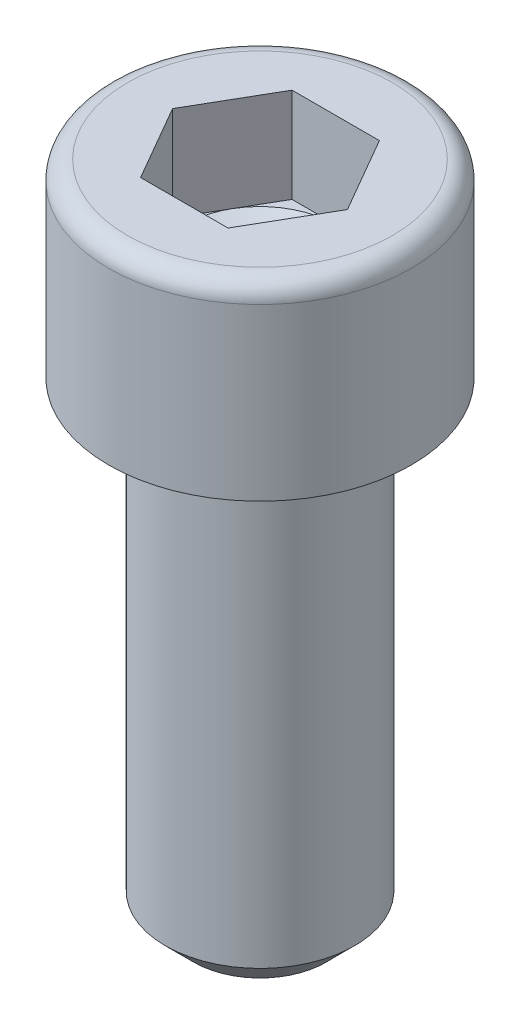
ISO-10303-21;
HEADER;
FILE_DESCRIPTION(('STEP AP214'),'2;1');
FILE_NAME('part.step','',(''),(''),'','','');
FILE_SCHEMA(('AUTOMOTIVE_DESIGN { 1 0 10303 214 1 1 1 1 }'));
ENDSEC;
DATA;
#1=APPLICATION_CONTEXT('core data for automotive mechanical design processes');
#2=APPLICATION_PROTOCOL_DEFINITION('international standard','automotive_design',2000,#1);
#3=PRODUCT_CONTEXT('',#1,'mechanical');
#4=PRODUCT('Part','Part','',(#3));
#5=PRODUCT_RELATED_PRODUCT_CATEGORY('part','',(#4));
#6=PRODUCT_DEFINITION_FORMATION('','',#4);
#7=PRODUCT_DEFINITION_CONTEXT('part definition',#1,'design');
#8=PRODUCT_DEFINITION('design','',#6,#7);
#9=PRODUCT_DEFINITION_SHAPE('','',#8);
#10=(LENGTH_UNIT() NAMED_UNIT(*) SI_UNIT(.MILLI.,.METRE.));
#11=(NAMED_UNIT(*) PLANE_ANGLE_UNIT() SI_UNIT($,.RADIAN.));
#12=(NAMED_UNIT(*) SI_UNIT($,.STERADIAN.) SOLID_ANGLE_UNIT());
#13=UNCERTAINTY_MEASURE_WITH_UNIT(LENGTH_MEASURE(1.E-05),#10,'distance_accuracy_value','');
#14=(GEOMETRIC_REPRESENTATION_CONTEXT(3) GLOBAL_UNCERTAINTY_ASSIGNED_CONTEXT((#13)) GLOBAL_UNIT_ASSIGNED_CONTEXT((#10,
#11,#12)) REPRESENTATION_CONTEXT('',''));
#15=CARTESIAN_POINT('',(0.,0.,0.));
#16=DIRECTION('',(0.,0.,1.));
#17=DIRECTION('',(1.,0.,0.));
#18=AXIS2_PLACEMENT_3D('',#15,#16,#17);
#19=CARTESIAN_POINT('',(4.,10.,0.));
#20=DIRECTION('',(0.,-1.,0.));
#21=DIRECTION('',(1.,0.,0.));
#22=AXIS2_PLACEMENT_3D('',#19,#20,#21);
#23=PLANE('',#22);
#24=CARTESIAN_POINT('',(0.,10.,0.));
#25=DIRECTION('',(0.,1.,0.));
#26=DIRECTION('',(-1.,0.,0.));
#27=AXIS2_PLACEMENT_3D('',#24,#25,#26);
#28=CIRCLE('',#27,7.);
#29=CARTESIAN_POINT('',(-7.,10.,0.));
#30=VERTEX_POINT('',#29);
#31=EDGE_CURVE('E138',#30,#30,#28,.T.);
#32=ORIENTED_EDGE('',*,*,#31,.T.);
#33=EDGE_LOOP('',(#32));
#34=FACE_BOUND('',#33,.T.);
#35=DIRECTION('',(0.499999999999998,0.,0.86602540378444));
#36=VECTOR('',#35,1.);
#37=CARTESIAN_POINT('',(2.30940107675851,10.,-4.));
#38=LINE('',#37,#36);
#39=CARTESIAN_POINT('',(2.30940107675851,10.,-4.));
#40=VERTEX_POINT('',#39);
#41=CARTESIAN_POINT('',(4.618802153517,10.,0.));
#42=VERTEX_POINT('',#41);
#43=EDGE_CURVE('E370',#40,#42,#38,.T.);
#44=ORIENTED_EDGE('',*,*,#43,.T.);
#45=DIRECTION('',(-0.499999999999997,0.,0.86602540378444));
#46=VECTOR('',#45,1.);
#47=CARTESIAN_POINT('',(2.30940107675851,10.,4.));
#48=LINE('',#47,#46);
#49=CARTESIAN_POINT('',(2.30940107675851,10.,4.));
#50=VERTEX_POINT('',#49);
#51=EDGE_CURVE('E373',#42,#50,#48,.T.);
#52=ORIENTED_EDGE('',*,*,#51,.T.);
#53=DIRECTION('',(-1.,0.,0.));
#54=VECTOR('',#53,1.);
#55=CARTESIAN_POINT('',(2.30940107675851,10.,4.));
#56=LINE('',#55,#54);
#57=CARTESIAN_POINT('',(-2.30940107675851,10.,4.));
#58=VERTEX_POINT('',#57);
#59=EDGE_CURVE('E376',#50,#58,#56,.T.);
#60=ORIENTED_EDGE('',*,*,#59,.T.);
#61=DIRECTION('',(-0.499999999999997,0.,-0.86602540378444));
#62=VECTOR('',#61,1.);
#63=CARTESIAN_POINT('',(-2.30940107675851,10.,4.));
#64=LINE('',#63,#62);
#65=CARTESIAN_POINT('',(-4.618802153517,10.,0.));
#66=VERTEX_POINT('',#65);
#67=EDGE_CURVE('E115',#58,#66,#64,.T.);
#68=ORIENTED_EDGE('',*,*,#67,.T.);
#69=DIRECTION('',(0.499999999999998,0.,-0.86602540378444));
#70=VECTOR('',#69,1.);
#71=CARTESIAN_POINT('',(-2.30940107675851,10.,-4.));
#72=LINE('',#71,#70);
#73=CARTESIAN_POINT('',(-2.30940107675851,10.,-4.));
#74=VERTEX_POINT('',#73);
#75=EDGE_CURVE('E367',#66,#74,#72,.T.);
#76=ORIENTED_EDGE('',*,*,#75,.T.);
#77=DIRECTION('',(1.,0.,0.));
#78=VECTOR('',#77,1.);
#79=CARTESIAN_POINT('',(2.30940107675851,10.,-4.));
#80=LINE('',#79,#78);
#81=EDGE_CURVE('E126',#74,#40,#80,.T.);
#82=ORIENTED_EDGE('',*,*,#81,.T.);
#83=EDGE_LOOP('',(#44,#52,#60,#68,#76,#82));
#84=FACE_BOUND('',#83,.T.);
#85=ADVANCED_FACE('F32',(#34,#84),#23,.F.);
#86=CARTESIAN_POINT('',(0.,-25.,0.));
#87=DIRECTION('',(0.,1.,0.));
#88=DIRECTION('',(0.,0.,1.));
#89=AXIS2_PLACEMENT_3D('',#86,#87,#88);
#90=CYLINDRICAL_SURFACE('',#89,5.);
#91=CARTESIAN_POINT('',(0.,-23.5,0.));
#92=DIRECTION('',(0.,1.,0.));
#93=DIRECTION('',(0.,0.,1.));
#94=AXIS2_PLACEMENT_3D('',#91,#92,#93);
#95=CIRCLE('',#94,5.);
#96=CARTESIAN_POINT('',(0.,-23.5,5.));
#97=VERTEX_POINT('',#96);
#98=EDGE_CURVE('E40',#97,#97,#95,.T.);
#99=ORIENTED_EDGE('',*,*,#98,.T.);
#100=EDGE_LOOP('',(#99));
#101=FACE_BOUND('',#100,.T.);
#102=CARTESIAN_POINT('',(0.,0.,0.));
#103=DIRECTION('',(0.,1.,0.));
#104=DIRECTION('',(0.,0.,1.));
#105=AXIS2_PLACEMENT_3D('',#102,#103,#104);
#106=CIRCLE('',#105,5.);
#107=CARTESIAN_POINT('',(0.,0.,5.));
#108=VERTEX_POINT('',#107);
#109=EDGE_CURVE('E148',#108,#108,#106,.T.);
#110=ORIENTED_EDGE('',*,*,#109,.F.);
#111=EDGE_LOOP('',(#110));
#112=FACE_BOUND('',#111,.T.);
#113=ADVANCED_FACE('F153',(#101,#112),#90,.T.);
#114=CARTESIAN_POINT('',(0.,-25.,0.));
#115=DIRECTION('',(0.,1.,0.));
#116=DIRECTION('',(0.,0.,1.));
#117=AXIS2_PLACEMENT_3D('',#114,#115,#116);
#118=PLANE('',#117);
#119=CARTESIAN_POINT('',(0.,-25.,0.));
#120=DIRECTION('',(0.,1.,0.));
#121=DIRECTION('',(0.,0.,1.));
#122=AXIS2_PLACEMENT_3D('',#119,#120,#121);
#123=CIRCLE('',#122,3.49999999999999);
#124=CARTESIAN_POINT('',(0.,-25.,3.49999999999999));
#125=VERTEX_POINT('',#124);
#126=EDGE_CURVE('E11',#125,#125,#123,.F.);
#127=ORIENTED_EDGE('',*,*,#126,.T.);
#128=EDGE_LOOP('',(#127));
#129=FACE_BOUND('',#128,.T.);
#130=ADVANCED_FACE('F158',(#129),#118,.F.);
#131=CARTESIAN_POINT('',(0.,-23.5,0.));
#132=DIRECTION('',(0.,1.,0.));
#133=DIRECTION('',(0.,0.,1.));
#134=AXIS2_PLACEMENT_3D('',#131,#132,#133);
#135=CONICAL_SURFACE('',#134,5.,0.785398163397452);
#136=ORIENTED_EDGE('',*,*,#126,.F.);
#137=EDGE_LOOP('',(#136));
#138=FACE_BOUND('',#137,.T.);
#139=ORIENTED_EDGE('',*,*,#98,.F.);
#140=EDGE_LOOP('',(#139));
#141=FACE_BOUND('',#140,.T.);
#142=ADVANCED_FACE('F34',(#138,#141),#135,.T.);
#143=CARTESIAN_POINT('',(0.,0.,0.));
#144=DIRECTION('',(0.,1.,0.));
#145=DIRECTION('',(-1.,0.,0.));
#146=AXIS2_PLACEMENT_3D('',#143,#144,#145);
#147=PLANE('',#146);
#148=ORIENTED_EDGE('',*,*,#109,.T.);
#149=EDGE_LOOP('',(#148));
#150=FACE_BOUND('',#149,.T.);
#151=CARTESIAN_POINT('',(0.,0.,0.));
#152=DIRECTION('',(0.,1.,0.));
#153=DIRECTION('',(-1.,0.,0.));
#154=AXIS2_PLACEMENT_3D('',#151,#152,#153);
#155=CIRCLE('',#154,8.);
#156=CARTESIAN_POINT('',(-8.,0.,0.));
#157=VERTEX_POINT('',#156);
#158=EDGE_CURVE('E145',#157,#157,#155,.T.);
#159=ORIENTED_EDGE('',*,*,#158,.F.);
#160=EDGE_LOOP('',(#159));
#161=FACE_BOUND('',#160,.T.);
#162=ADVANCED_FACE('F157',(#150,#161),#147,.F.);
#163=CARTESIAN_POINT('',(0.,10.,0.));
#164=DIRECTION('',(0.,1.,0.));
#165=DIRECTION('',(-1.,0.,0.));
#166=AXIS2_PLACEMENT_3D('',#163,#164,#165);
#167=CYLINDRICAL_SURFACE('',#166,8.);
#168=CARTESIAN_POINT('',(0.,9.,0.));
#169=DIRECTION('',(0.,1.,0.));
#170=DIRECTION('',(-1.,0.,0.));
#171=AXIS2_PLACEMENT_3D('',#168,#169,#170);
#172=CIRCLE('',#171,8.);
#173=CARTESIAN_POINT('',(-8.,9.,0.));
#174=VERTEX_POINT('',#173);
#175=EDGE_CURVE('E142',#174,#174,#172,.T.);
#176=ORIENTED_EDGE('',*,*,#175,.F.);
#177=EDGE_LOOP('',(#176));
#178=FACE_BOUND('',#177,.T.);
#179=ORIENTED_EDGE('',*,*,#158,.T.);
#180=EDGE_LOOP('',(#179));
#181=FACE_BOUND('',#180,.T.);
#182=ADVANCED_FACE('F164',(#178,#181),#167,.T.);
#183=CARTESIAN_POINT('',(0.,9.,0.));
#184=DIRECTION('',(0.,1.,0.));
#185=DIRECTION('',(-1.,0.,0.));
#186=AXIS2_PLACEMENT_3D('',#183,#184,#185);
#187=TOROIDAL_SURFACE('',#186,7.,0.999999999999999);
#188=ORIENTED_EDGE('',*,*,#31,.F.);
#189=EDGE_LOOP('',(#188));
#190=FACE_BOUND('',#189,.T.);
#191=ORIENTED_EDGE('',*,*,#175,.T.);
#192=EDGE_LOOP('',(#191));
#193=FACE_BOUND('',#192,.T.);
#194=ADVANCED_FACE('F181',(#190,#193),#187,.T.);
#195=CARTESIAN_POINT('',(-2.30940107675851,5.,-4.));
#196=DIRECTION('',(0.86602540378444,0.,0.499999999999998));
#197=DIRECTION('',(0.499999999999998,0.,-0.86602540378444));
#198=AXIS2_PLACEMENT_3D('',#195,#196,#197);
#199=PLANE('',#198);
#200=ORIENTED_EDGE('',*,*,#75,.F.);
#201=DIRECTION('',(0.,1.,0.));
#202=VECTOR('',#201,1.);
#203=CARTESIAN_POINT('',(-4.618802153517,5.,0.));
#204=LINE('',#203,#202);
#205=CARTESIAN_POINT('',(-4.618802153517,5.,0.));
#206=VERTEX_POINT('',#205);
#207=EDGE_CURVE('E362',#206,#66,#204,.T.);
#208=ORIENTED_EDGE('',*,*,#207,.F.);
#209=DIRECTION('',(0.499999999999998,0.,-0.86602540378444));
#210=VECTOR('',#209,1.);
#211=CARTESIAN_POINT('',(-2.30940107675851,5.,-4.));
#212=LINE('',#211,#210);
#213=CARTESIAN_POINT('',(-3.46410161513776,5.,-1.99999999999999));
#214=VERTEX_POINT('',#213);
#215=EDGE_CURVE('E111',#206,#214,#212,.T.);
#216=ORIENTED_EDGE('',*,*,#215,.T.);
#217=CARTESIAN_POINT('',(-2.30940107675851,5.,-4.));
#218=VERTEX_POINT('',#217);
#219=EDGE_CURVE('E105',#214,#218,#212,.T.);
#220=ORIENTED_EDGE('',*,*,#219,.T.);
#221=DIRECTION('',(0.,1.,0.));
#222=VECTOR('',#221,1.);
#223=CARTESIAN_POINT('',(-2.30940107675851,5.,-4.));
#224=LINE('',#223,#222);
#225=EDGE_CURVE('E107',#218,#74,#224,.T.);
#226=ORIENTED_EDGE('',*,*,#225,.T.);
#227=EDGE_LOOP('',(#200,#208,#216,#220,#226));
#228=FACE_BOUND('',#227,.T.);
#229=ADVANCED_FACE('F106',(#228),#199,.T.);
#230=CARTESIAN_POINT('',(2.30940107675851,5.,-4.));
#231=DIRECTION('',(0.,0.,1.));
#232=DIRECTION('',(1.,0.,0.));
#233=AXIS2_PLACEMENT_3D('',#230,#231,#232);
#234=PLANE('',#233);
#235=ORIENTED_EDGE('',*,*,#81,.F.);
#236=ORIENTED_EDGE('',*,*,#225,.F.);
#237=DIRECTION('',(1.,0.,0.));
#238=VECTOR('',#237,1.);
#239=CARTESIAN_POINT('',(2.30940107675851,5.,-4.));
#240=LINE('',#239,#238);
#241=CARTESIAN_POINT('',(0.,5.,-4.));
#242=VERTEX_POINT('',#241);
#243=EDGE_CURVE('E47',#218,#242,#240,.T.);
#244=ORIENTED_EDGE('',*,*,#243,.T.);
#245=CARTESIAN_POINT('',(2.30940107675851,5.,-4.));
#246=VERTEX_POINT('',#245);
#247=EDGE_CURVE('E121',#242,#246,#240,.T.);
#248=ORIENTED_EDGE('',*,*,#247,.T.);
#249=DIRECTION('',(0.,1.,0.));
#250=VECTOR('',#249,1.);
#251=CARTESIAN_POINT('',(2.30940107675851,5.,-4.));
#252=LINE('',#251,#250);
#253=EDGE_CURVE('E128',#246,#40,#252,.T.);
#254=ORIENTED_EDGE('',*,*,#253,.T.);
#255=EDGE_LOOP('',(#235,#236,#244,#248,#254));
#256=FACE_BOUND('',#255,.T.);
#257=ADVANCED_FACE('F123',(#256),#234,.T.);
#258=CARTESIAN_POINT('',(2.30940107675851,5.,-4.));
#259=DIRECTION('',(-0.86602540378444,0.,0.499999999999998));
#260=DIRECTION('',(0.499999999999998,0.,0.86602540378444));
#261=AXIS2_PLACEMENT_3D('',#258,#259,#260);
#262=PLANE('',#261);
#263=ORIENTED_EDGE('',*,*,#43,.F.);
#264=ORIENTED_EDGE('',*,*,#253,.F.);
#265=DIRECTION('',(0.499999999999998,0.,0.86602540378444));
#266=VECTOR('',#265,1.);
#267=CARTESIAN_POINT('',(2.30940107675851,5.,-4.));
#268=LINE('',#267,#266);
#269=CARTESIAN_POINT('',(3.46410161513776,5.,-1.99999999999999));
#270=VERTEX_POINT('',#269);
#271=EDGE_CURVE('E395',#246,#270,#268,.T.);
#272=ORIENTED_EDGE('',*,*,#271,.T.);
#273=CARTESIAN_POINT('',(4.618802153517,5.,0.));
#274=VERTEX_POINT('',#273);
#275=EDGE_CURVE('E120',#270,#274,#268,.T.);
#276=ORIENTED_EDGE('',*,*,#275,.T.);
#277=DIRECTION('',(0.,1.,0.));
#278=VECTOR('',#277,1.);
#279=CARTESIAN_POINT('',(4.618802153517,5.,0.));
#280=LINE('',#279,#278);
#281=EDGE_CURVE('E133',#274,#42,#280,.T.);
#282=ORIENTED_EDGE('',*,*,#281,.T.);
#283=EDGE_LOOP('',(#263,#264,#272,#276,#282));
#284=FACE_BOUND('',#283,.T.);
#285=ADVANCED_FACE('F211',(#284),#262,.T.);
#286=CARTESIAN_POINT('',(2.30940107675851,5.,4.));
#287=DIRECTION('',(-0.86602540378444,0.,-0.499999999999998));
#288=DIRECTION('',(-0.499999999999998,0.,0.86602540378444));
#289=AXIS2_PLACEMENT_3D('',#286,#287,#288);
#290=PLANE('',#289);
#291=ORIENTED_EDGE('',*,*,#51,.F.);
#292=ORIENTED_EDGE('',*,*,#281,.F.);
#293=DIRECTION('',(-0.499999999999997,0.,0.86602540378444));
#294=VECTOR('',#293,1.);
#295=CARTESIAN_POINT('',(2.30940107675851,5.,4.));
#296=LINE('',#295,#294);
#297=CARTESIAN_POINT('',(3.46410161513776,5.,1.99999999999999));
#298=VERTEX_POINT('',#297);
#299=EDGE_CURVE('E393',#274,#298,#296,.T.);
#300=ORIENTED_EDGE('',*,*,#299,.T.);
#301=CARTESIAN_POINT('',(2.30940107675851,5.,4.));
#302=VERTEX_POINT('',#301);
#303=EDGE_CURVE('E394',#298,#302,#296,.T.);
#304=ORIENTED_EDGE('',*,*,#303,.T.);
#305=DIRECTION('',(0.,1.,0.));
#306=VECTOR('',#305,1.);
#307=CARTESIAN_POINT('',(2.30940107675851,5.,4.));
#308=LINE('',#307,#306);
#309=EDGE_CURVE('E382',#302,#50,#308,.T.);
#310=ORIENTED_EDGE('',*,*,#309,.T.);
#311=EDGE_LOOP('',(#291,#292,#300,#304,#310));
#312=FACE_BOUND('',#311,.T.);
#313=ADVANCED_FACE('F218',(#312),#290,.T.);
#314=CARTESIAN_POINT('',(2.30940107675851,5.,4.));
#315=DIRECTION('',(0.,0.,-1.));
#316=DIRECTION('',(-1.,0.,0.));
#317=AXIS2_PLACEMENT_3D('',#314,#315,#316);
#318=PLANE('',#317);
#319=ORIENTED_EDGE('',*,*,#59,.F.);
#320=ORIENTED_EDGE('',*,*,#309,.F.);
#321=DIRECTION('',(-1.,0.,0.));
#322=VECTOR('',#321,1.);
#323=CARTESIAN_POINT('',(2.30940107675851,5.,4.));
#324=LINE('',#323,#322);
#325=CARTESIAN_POINT('',(0.,5.,4.));
#326=VERTEX_POINT('',#325);
#327=EDGE_CURVE('E357',#302,#326,#324,.T.);
#328=ORIENTED_EDGE('',*,*,#327,.T.);
#329=CARTESIAN_POINT('',(-2.30940107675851,5.,4.));
#330=VERTEX_POINT('',#329);
#331=EDGE_CURVE('E353',#326,#330,#324,.T.);
#332=ORIENTED_EDGE('',*,*,#331,.T.);
#333=DIRECTION('',(0.,1.,0.));
#334=VECTOR('',#333,1.);
#335=CARTESIAN_POINT('',(-2.30940107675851,5.,4.));
#336=LINE('',#335,#334);
#337=EDGE_CURVE('E361',#330,#58,#336,.T.);
#338=ORIENTED_EDGE('',*,*,#337,.T.);
#339=EDGE_LOOP('',(#319,#320,#328,#332,#338));
#340=FACE_BOUND('',#339,.T.);
#341=ADVANCED_FACE('F226',(#340),#318,.T.);
#342=CARTESIAN_POINT('',(-2.30940107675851,5.,4.));
#343=DIRECTION('',(0.86602540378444,0.,-0.499999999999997));
#344=DIRECTION('',(-0.499999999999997,0.,-0.86602540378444));
#345=AXIS2_PLACEMENT_3D('',#342,#343,#344);
#346=PLANE('',#345);
#347=ORIENTED_EDGE('',*,*,#67,.F.);
#348=ORIENTED_EDGE('',*,*,#337,.F.);
#349=DIRECTION('',(-0.499999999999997,0.,-0.86602540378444));
#350=VECTOR('',#349,1.);
#351=CARTESIAN_POINT('',(-2.30940107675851,5.,4.));
#352=LINE('',#351,#350);
#353=CARTESIAN_POINT('',(-3.46410161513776,5.,1.99999999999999));
#354=VERTEX_POINT('',#353);
#355=EDGE_CURVE('E352',#330,#354,#352,.T.);
#356=ORIENTED_EDGE('',*,*,#355,.T.);
#357=EDGE_CURVE('E355',#354,#206,#352,.T.);
#358=ORIENTED_EDGE('',*,*,#357,.T.);
#359=ORIENTED_EDGE('',*,*,#207,.T.);
#360=EDGE_LOOP('',(#347,#348,#356,#358,#359));
#361=FACE_BOUND('',#360,.T.);
#362=ADVANCED_FACE('F234',(#361),#346,.T.);
#363=CARTESIAN_POINT('',(-6.92820323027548,5.,4.));
#364=DIRECTION('',(0.,-1.,0.));
#365=DIRECTION('',(0.,0.,-1.));
#366=AXIS2_PLACEMENT_3D('',#363,#364,#365);
#367=PLANE('',#366);
#368=ORIENTED_EDGE('',*,*,#243,.F.);
#369=ORIENTED_EDGE('',*,*,#219,.F.);
#370=CARTESIAN_POINT('',(0.,5.,0.));
#371=DIRECTION('',(0.,1.,0.));
#372=DIRECTION('',(-1.,0.,0.));
#373=AXIS2_PLACEMENT_3D('',#370,#371,#372);
#374=CIRCLE('',#373,4.);
#375=EDGE_CURVE('E118',#242,#214,#374,.T.);
#376=ORIENTED_EDGE('',*,*,#375,.F.);
#377=EDGE_LOOP('',(#368,#369,#376));
#378=FACE_BOUND('',#377,.T.);
#379=ADVANCED_FACE('F117',(#378),#367,.F.);
#380=ORIENTED_EDGE('',*,*,#215,.F.);
#381=ORIENTED_EDGE('',*,*,#357,.F.);
#382=EDGE_CURVE('E127',#214,#354,#374,.T.);
#383=ORIENTED_EDGE('',*,*,#382,.F.);
#384=EDGE_LOOP('',(#380,#381,#383));
#385=FACE_BOUND('',#384,.T.);
#386=ADVANCED_FACE('F249',(#385),#367,.F.);
#387=ORIENTED_EDGE('',*,*,#355,.F.);
#388=ORIENTED_EDGE('',*,*,#331,.F.);
#389=EDGE_CURVE('E132',#354,#326,#374,.T.);
#390=ORIENTED_EDGE('',*,*,#389,.F.);
#391=EDGE_LOOP('',(#387,#388,#390));
#392=FACE_BOUND('',#391,.T.);
#393=ADVANCED_FACE('F257',(#392),#367,.F.);
#394=ORIENTED_EDGE('',*,*,#327,.F.);
#395=ORIENTED_EDGE('',*,*,#303,.F.);
#396=EDGE_CURVE('E139',#326,#298,#374,.T.);
#397=ORIENTED_EDGE('',*,*,#396,.F.);
#398=EDGE_LOOP('',(#394,#395,#397));
#399=FACE_BOUND('',#398,.T.);
#400=ADVANCED_FACE('F264',(#399),#367,.F.);
#401=ORIENTED_EDGE('',*,*,#299,.F.);
#402=ORIENTED_EDGE('',*,*,#275,.F.);
#403=EDGE_CURVE('E399',#298,#270,#374,.T.);
#404=ORIENTED_EDGE('',*,*,#403,.F.);
#405=EDGE_LOOP('',(#401,#402,#404));
#406=FACE_BOUND('',#405,.T.);
#407=ADVANCED_FACE('F271',(#406),#367,.F.);
#408=ORIENTED_EDGE('',*,*,#271,.F.);
#409=ORIENTED_EDGE('',*,*,#247,.F.);
#410=EDGE_CURVE('E398',#270,#242,#374,.T.);
#411=ORIENTED_EDGE('',*,*,#410,.F.);
#412=EDGE_LOOP('',(#408,#409,#411));
#413=FACE_BOUND('',#412,.T.);
#414=ADVANCED_FACE('F251',(#413),#367,.F.);
#415=CARTESIAN_POINT('',(0.,5.,0.));
#416=DIRECTION('',(0.,1.,0.));
#417=DIRECTION('',(-1.,0.,0.));
#418=AXIS2_PLACEMENT_3D('',#415,#416,#417);
#419=CONICAL_SURFACE('',#418,4.,1.04719755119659);
#420=CARTESIAN_POINT('',(0.,2.69059892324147,0.));
#421=VERTEX_POINT('',#420);
#422=VERTEX_LOOP('',#421);
#423=FACE_BOUND('',#422,.T.);
#424=ORIENTED_EDGE('',*,*,#389,.T.);
#425=ORIENTED_EDGE('',*,*,#396,.T.);
#426=ORIENTED_EDGE('',*,*,#403,.T.);
#427=ORIENTED_EDGE('',*,*,#410,.T.);
#428=ORIENTED_EDGE('',*,*,#375,.T.);
#429=ORIENTED_EDGE('',*,*,#382,.T.);
#430=EDGE_LOOP('',(#424,#425,#426,#427,#428,#429));
#431=FACE_BOUND('',#430,.T.);
#432=ADVANCED_FACE('F179',(#423,#431),#419,.F.);
#433=CLOSED_SHELL('',(#85,#113,#130,#142,#162,#182,#194,#229,#257,#285,#313,#341,#362,#379,#386,
#393,#400,#407,#414,#432));
#434=MANIFOLD_SOLID_BREP('B2',#433);
#435=ADVANCED_BREP_SHAPE_REPRESENTATION('',(#18,#434),#14);
#436=SHAPE_DEFINITION_REPRESENTATION(#9,#435);
ENDSEC;
END-ISO-10303-21;
